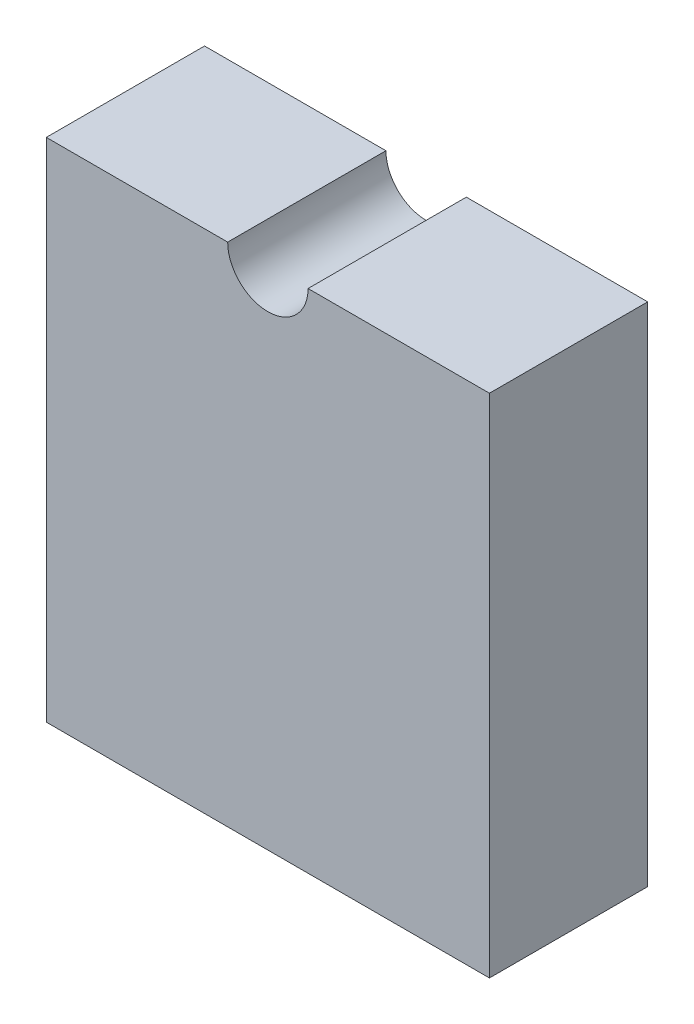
from build123d import *

# Parameters (mm, degrees)
BOSS_EXTRUDE2_DEPTH = 50
BOSS_EXTRUDE3_DEPTH = 25


with BuildPart() as part:
    # Sketch2 → Boss-Extrude2 (new body)
    with BuildSketch(Plane(origin=(0, 0, 0), x_dir=(1, 0, 0), z_dir=(0, 1, 0))):
        with BuildLine():
            Line((-15, 0), (-35, 0))
            Line((-35, 0), (-35, -25))
            Line((-35, -25), (35, -25))
            Line((35, -25), (35, 0))
            Line((35, 0), (15, 0))
            ThreePointArc((15, 0), (0, -15), (-15, 0))
        make_face()
    extrude(amount=-BOSS_EXTRUDE2_DEPTH)

    # Sketch3 → Boss-Extrude3 (add)
    with BuildSketch(Plane.XY.offset(25)):
        with BuildLine():
            Line((-35, 30), (-35, 0))
            Line((-35, 0), (35, 0))
            Line((35, 0), (35, 30))
            Line((35, 30), (6.35, 30))
            ThreePointArc((6.35, 30), (0, 23.65), (-6.35, 30))
            Line((-6.35, 30), (-35, 30))
        make_face()
    extrude(amount=-BOSS_EXTRUDE3_DEPTH)


solid = part.part
